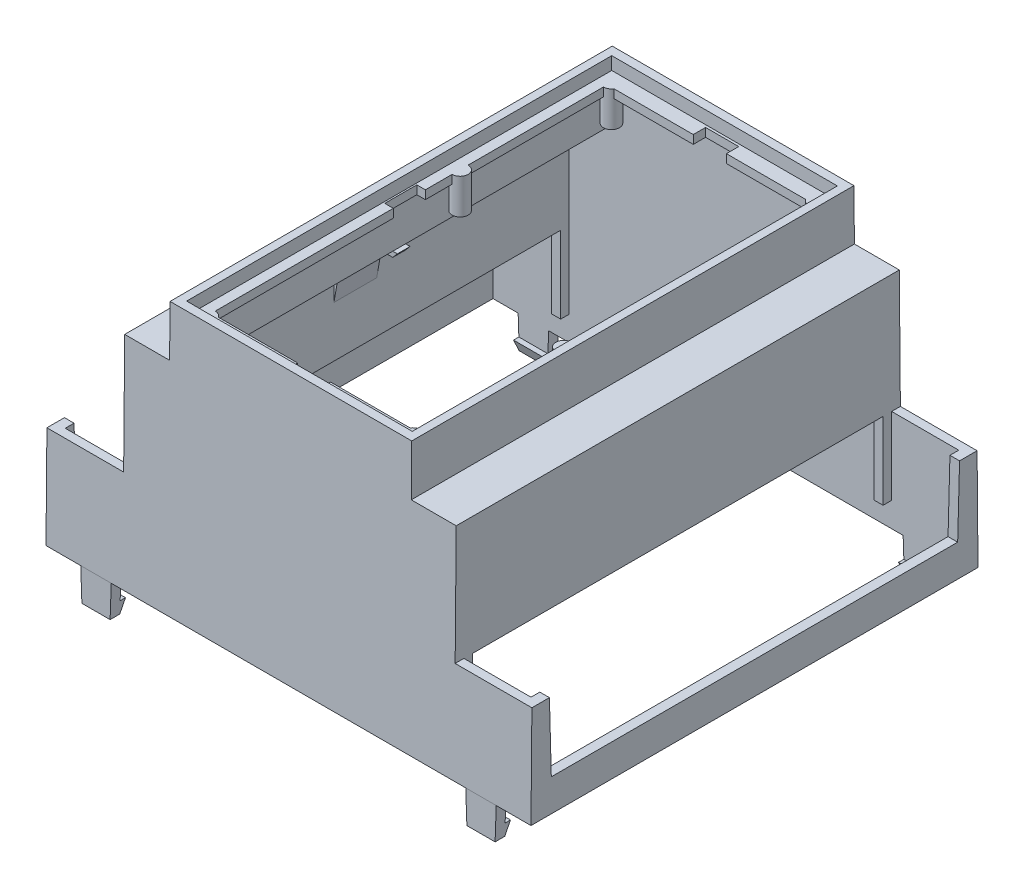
from build123d import *

# Parameters (mm, degrees)
EXTRUDE_1_DEPTH           = 41.8
CUT_EXTRUDE_1_DEPTH       = 43.55
SKETCH_4_W                = 12.55
SKETCH_4_H                = 80
CUT_EXTRUDE_2_DEPTH       = 19
CUT_EXTRUDE_3_DEPTH       = 46
SKETCH_6_W                = 62
SKETCH_6_H                = 76.8
CUT_EXTRUDE_4_DEPTH       = 14.4
SKETCH_7_W                = 58.6
SKETCH_7_H                = 80
CUT_EXTRUDE_5_DEPTH       = 14.4
SKETCH_8_W                = 58.6
SKETCH_8_H                = 80
CUT_EXTRUDE_6_DEPTH       = 20.5
SKETCH_9_W                = 42.2
SKETCH_9_H                = 80
CUT_EXTRUDE_7_DEPTH       = 7.2
CUT_EXTRUDE_10_DEPTH      = 46
SKETCH_10_W               = 42.2
SKETCH_10_H               = 79.5
CUT_EXTRUDE_8_DEPTH       = 2.4
CUT_EXTRUDE_9_DEPTH       = 2.4
EXTRUDE_2_DEPTH           = 1.2
EXTRUDE_3_DEPTH           = 4
SKETCH_14_R               = 1.3
EXTRUDE_4_DEPTH           = 4.4
EXTRUDE_4_DRAFT           = 3
EXTRUDE_4_PROFILE_2_DEPTH = 4.4
EXTRUDE_4_PROFILE_2_DRAFT = 3
EXTRUDE_4_PROFILE_3_DEPTH = 4.4
EXTRUDE_4_PROFILE_3_DRAFT = 3
EXTRUDE_4_PROFILE_4_DEPTH = 4.4
EXTRUDE_4_PROFILE_4_DRAFT = 3
SKETCH_15_R               = 1.5
EXTRUDE_5_DEPTH           = 6.6


with BuildPart() as part:
    # Sketch 2 → Extrude 1 (new, symmetric)
    with BuildSketch(Plane.XY):
        Polygon((-38.85, 6), (-38.640475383, 0), (-33.359524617, 0), (-33.15, 6), (33.15, 6), (33.359524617, 0), (38.640475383, 0), (38.85, 6), (45.35, 6), (45.35, 25), (31, 25), (31, 47.2), (22.6, 47.2), (22.6, 56.7), (-22.6, 56.7), (-22.6, 47.2), (-31, 47.2), (-31, 25), (-45.35, 25), (-45.35, 6), align=None)
    extrude(amount=EXTRUDE_1_DEPTH, both=True)

    # Sketch 3 → Cut-Extrude 1 (cut, symmetric)
    with BuildSketch(Plane(origin=(0, 0, 0), x_dir=(0, 0, -1), z_dir=(1, 0, 0))):
        Polygon((-40, 10.6), (40, 10.6), (40, 2.2), (39, 2.2), (40, 0), (-40, 0), (-39, 2.2), (-40, 2.2), align=None)
    extrude(amount=CUT_EXTRUDE_1_DEPTH, both=True, mode=Mode.SUBTRACT)

    # Sketch 4 → Cut-Extrude 2 (cut)
    with BuildSketch(Plane(origin=(0, 25, 0), x_dir=(1, 0, 0), z_dir=(0, 1, 0))):
        with Locations((37.275, 0)):
            Rectangle(SKETCH_4_W, SKETCH_4_H)
        with Locations((-37.275, 0)):
            Rectangle(SKETCH_4_W, SKETCH_4_H)
    extrude(amount=-CUT_EXTRUDE_2_DEPTH, mode=Mode.SUBTRACT)

    # Sketch 5 → Cut-Extrude 3 (cut, symmetric)
    with BuildSketch(Plane(origin=(0, 0, 0), x_dir=(0, 0, -1), z_dir=(1, 0, 0))):
        Polygon((-38.351769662, 25), (-38, 12), (38, 12), (38.351769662, 25), align=None)
    extrude(amount=CUT_EXTRUDE_3_DEPTH, both=True, mode=Mode.SUBTRACT)

    # Sketch 6 → Cut-Extrude 4 (cut)
    with BuildSketch(Plane.XZ.offset(-10.6)):
        Rectangle(SKETCH_6_W, SKETCH_6_H)
    extrude(amount=-CUT_EXTRUDE_4_DEPTH, mode=Mode.SUBTRACT)

    # Sketch 7 → Cut-Extrude 5 (cut)
    with BuildSketch(Plane.XZ.offset(-10.6)):
        Rectangle(SKETCH_7_W, SKETCH_7_H)
    extrude(amount=-CUT_EXTRUDE_5_DEPTH, mode=Mode.SUBTRACT)

    # Sketch 8 → Cut-Extrude 6 (cut)
    with BuildSketch(Plane.XZ.offset(-25)):
        Rectangle(SKETCH_8_W, SKETCH_8_H)
    extrude(amount=-CUT_EXTRUDE_6_DEPTH, mode=Mode.SUBTRACT)

    # Sketch 9 → Cut-Extrude 7 (cut)
    with BuildSketch(Plane.XZ.offset(-45.5)):
        Rectangle(SKETCH_9_W, SKETCH_9_H)
    extrude(amount=-CUT_EXTRUDE_7_DEPTH, mode=Mode.SUBTRACT)

    # Sketch 16 → Cut-Extrude 10 (cut, symmetric)
    with BuildSketch(Plane(origin=(0, 0, 0), x_dir=(0, 0, -1), z_dir=(1, 0, 0))):
        Polygon((-41.8, 56.7), (-41.8, 6), (-41.35, 56.7), align=None)
        Polygon((41.35, 56.7), (41.8, 56.7), (41.8, 6), align=None)
    extrude(amount=CUT_EXTRUDE_10_DEPTH, both=True, mode=Mode.SUBTRACT)

    # Sketch 10 → Cut-Extrude 8 (cut)
    with BuildSketch(Plane(origin=(0, 56.7, 0), x_dir=(1, 0, 0), z_dir=(0, 1, 0))):
        Rectangle(SKETCH_10_W, SKETCH_10_H)
    extrude(amount=-CUT_EXTRUDE_8_DEPTH, mode=Mode.SUBTRACT)

    # Sketch 11 → Cut-Extrude 9 (cut)
    with BuildSketch(Plane(origin=(0, 54.3, 0), x_dir=(1, 0, 0), z_dir=(0, 1, 0))):
        Polygon((-3.1, 39.3), (3.1, 39.3), (3.1, 37), (19.2, 37), (19.2, 3), (20.8, 3), (20.8, -3), (19.2, -3), (19.2, -37), (3.1, -37), (3.1, -39.3), (-3.1, -39.3), (-3.1, -37), (-19.2, -37), (-19.2, -3), (-20.8, -3), (-20.8, 3), (-19.2, 3), (-19.2, 37), (-3.1, 37), align=None)
    extrude(amount=-CUT_EXTRUDE_9_DEPTH, mode=Mode.SUBTRACT)

    # Sketch 12 → Extrude 2 (add, symmetric)
    with BuildSketch(Plane.XY):
        Polygon((-29.3, 45.5), (-29.3, 44.5), (-21.1, 44.5), (-20.25, 45.5), align=None)
        Polygon((29.3, 45.5), (20.25, 45.5), (21.1, 44.5), (29.3, 44.5), align=None)
    extrude(amount=EXTRUDE_2_DEPTH, both=True)

    # Sketch 13 → Extrude 3 (add, symmetric)
    with BuildSketch(Plane.XY):
        Polygon((-29.3, 34.5), (-28.5, 39.1), (-29.3, 39.1), align=None)
        Polygon((29.3, 39.1), (28.5, 39.1), (29.3, 34.5), align=None)
    extrude(amount=EXTRUDE_3_DEPTH, both=True)


with BuildPart() as extrude_4_tool:
    # Sketch 14 → Extrude 4 (with draft: the straight prism first)
    with BuildSketch(Plane.XZ.offset(-45.5)):
        with Locations((-27.5, -37)):
            Circle(SKETCH_14_R)
    extrude(amount=EXTRUDE_4_DEPTH)
    # Extrude 4: the draft: its side faces are tilted about the plane it starts from
    extrude_4_sides = [extrude_4_tool.faces().sort_by_distance(p)[0] for p in [
        (-28.8, 43.3, -37),
    ]]
    draft(extrude_4_sides, Plane.XZ.offset(-45.5), EXTRUDE_4_DRAFT)


with BuildPart() as part_1:
    add(part.part)

    # Extrude 4: add extrude_4_tool
    add(extrude_4_tool.part)


with BuildPart() as extrude_4_profile_2_tool:
    # Sketch 14 → Extrude 4 profile 2 (with draft: the straight prism first)
    with BuildSketch(Plane.XZ.offset(-45.5)):
        with Locations((-27.5, 37)):
            Circle(SKETCH_14_R)
    extrude(amount=EXTRUDE_4_PROFILE_2_DEPTH)
    # Extrude 4 profile 2: the draft: its side faces are tilted about the plane it starts from
    extrude_4_profile_2_sides = [extrude_4_profile_2_tool.faces().sort_by_distance(p)[0] for p in [
        (-28.8, 43.3, 37),
    ]]
    draft(extrude_4_profile_2_sides, Plane.XZ.offset(-45.5), EXTRUDE_4_PROFILE_2_DRAFT)


with BuildPart() as part_2:
    add(part_1.part)

    # Extrude 4 profile 2: add extrude_4_profile_2_tool
    add(extrude_4_profile_2_tool.part)


with BuildPart() as extrude_4_profile_3_tool:
    # Sketch 14 → Extrude 4 profile 3 (with draft: the straight prism first)
    with BuildSketch(Plane.XZ.offset(-45.5)):
        with Locations((27.5, -37)):
            Circle(SKETCH_14_R)
    extrude(amount=EXTRUDE_4_PROFILE_3_DEPTH)
    # Extrude 4 profile 3: the draft: its side faces are tilted about the plane it starts from
    extrude_4_profile_3_sides = [extrude_4_profile_3_tool.faces().sort_by_distance(p)[0] for p in [
        (26.2, 43.3, -37),
    ]]
    draft(extrude_4_profile_3_sides, Plane.XZ.offset(-45.5), EXTRUDE_4_PROFILE_3_DRAFT)


with BuildPart() as part_3:
    add(part_2.part)

    # Extrude 4 profile 3: add extrude_4_profile_3_tool
    add(extrude_4_profile_3_tool.part)


with BuildPart() as extrude_4_profile_4_tool:
    # Sketch 14 → Extrude 4 profile 4 (with draft: the straight prism first)
    with BuildSketch(Plane.XZ.offset(-45.5)):
        with Locations((27.5, 37)):
            Circle(SKETCH_14_R)
    extrude(amount=EXTRUDE_4_PROFILE_4_DEPTH)
    # Extrude 4 profile 4: the draft: its side faces are tilted about the plane it starts from
    extrude_4_profile_4_sides = [extrude_4_profile_4_tool.faces().sort_by_distance(p)[0] for p in [
        (26.2, 43.3, 37),
    ]]
    draft(extrude_4_profile_4_sides, Plane.XZ.offset(-45.5), EXTRUDE_4_PROFILE_4_DRAFT)


with BuildPart() as part_4:
    add(part_3.part)

    # Extrude 4 profile 4: add extrude_4_profile_4_tool
    add(extrude_4_profile_4_tool.part)

    # Sketch 15 → Extrude 5 (add)
    with BuildSketch(Plane(origin=(0, 54.3, 0), x_dir=(1, 0, 0), z_dir=(0, 1, 0))):
        with Locations(Location((19.2, 37.8, 0), (0, 0, 270))):
            Circle(SKETCH_15_R)
        with Locations(Location((-19.2, 37.8, 0), (0, 0, 270))):
            Circle(SKETCH_15_R)
        with Locations(Location((-19.2, -37.8, 0), (0, 0, 270))):
            Circle(SKETCH_15_R)
        with Locations(Location((19.2, -37.8, 0), (0, 0, 270))):
            Circle(SKETCH_15_R)
        with Locations(Location((19.2, -9.5, 0), (0, 0, 270))):
            Circle(SKETCH_15_R)
        with Locations(Location((-19.2, 9.5, 0), (0, 0, 270))):
            Circle(SKETCH_15_R)
    extrude(amount=-EXTRUDE_5_DEPTH)


solid = part_4.part
